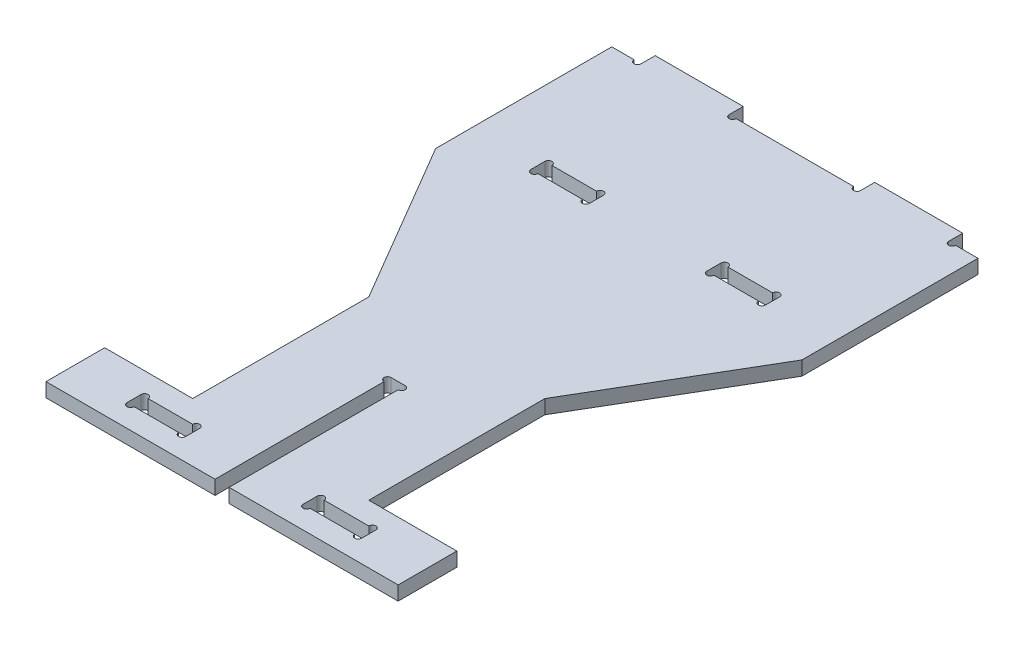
from build123d import *

# Parameters (mm, degrees)
BOSS_EXTRUDE1_DEPTH = 12


with BuildPart() as part:
    # Sketch1 → Boss-Extrude1 (new body)
    with BuildSketch(Plane(origin=(0, 0, 0), x_dir=(1, 0, 0), z_dir=(0, 1, 0))):
        with BuildLine():
            Line((-150, 0), (-6, 0))
            Line((-6, 0), (-6, 144))
            ThreePointArc((-6, 144), (-9, 147), (-6, 150))
            Line((-6, 150), (6, 150))
            ThreePointArc((6, 150), (9, 147), (6, 144))
            Line((6, 144), (6, 0))
            Line((6, 0), (150, 0))
            Line((150, 0), (150, 50))
            Line((150, 50), (75, 50))
            Line((75, 50), (75, 200))
            Line((75, 200), (156, 338))
            Line((156, 338), (156, 488))
            Line((156, 488), (137, 488))
            ThreePointArc((137, 488), (134, 485), (131, 488))
            Line((131, 488), (131, 500))
            Line((131, 500), (56, 500))
            Line((56, 500), (56, 488))
            ThreePointArc((56, 488), (53, 485), (50, 488))
            Line((50, 488), (0, 488))
            Line((0, 488), (-50, 488))
            ThreePointArc((-50, 488), (-53, 485), (-56, 488))
            Line((-56, 488), (-56, 500))
            Line((-56, 500), (-131, 500))
            Line((-131, 500), (-131, 488))
            ThreePointArc((-131, 488), (-134, 485), (-137, 488))
            Line((-137, 488), (-156, 488))
            Line((-156, 488), (-156, 338))
            Line((-156, 338), (-75, 200))
            Line((-75, 200), (-75, 50))
            Line((-75, 50), (-150, 50))
            Line((-150, 50), (-150, 0))
        make_face()
        with BuildLine():
            Line((56, 19), (94, 19))
            ThreePointArc((94, 19), (97, 16), (100, 19))
            Line((100, 19), (100, 31))
            ThreePointArc((100, 31), (97, 34), (94, 31))
            Line((94, 31), (56, 31))
            ThreePointArc((56, 31), (53, 34), (50, 31))
            Line((50, 31), (50, 19))
            ThreePointArc((50, 19), (53, 16), (56, 19))
        make_face(mode=Mode.SUBTRACT)
        with BuildLine():
            Line((56, 375), (94, 375))
            ThreePointArc((94, 375), (97, 378), (100, 375))
            Line((100, 375), (100, 363))
            ThreePointArc((100, 363), (97, 360), (94, 363))
            Line((94, 363), (56, 363))
            ThreePointArc((56, 363), (53, 360), (50, 363))
            Line((50, 363), (50, 375))
            ThreePointArc((50, 375), (53, 378), (56, 375))
        make_face(mode=Mode.SUBTRACT)
        with BuildLine():
            Line((-100, 31), (-100, 19))
            ThreePointArc((-100, 19), (-97, 16), (-94, 19))
            Line((-94, 19), (-56, 19))
            ThreePointArc((-56, 19), (-53, 16), (-50, 19))
            Line((-50, 19), (-50, 31))
            ThreePointArc((-50, 31), (-53, 34), (-56, 31))
            Line((-56, 31), (-94, 31))
            ThreePointArc((-94, 31), (-97, 34), (-100, 31))
        make_face(mode=Mode.SUBTRACT)
        with BuildLine():
            Line((-56, 375), (-94, 375))
            ThreePointArc((-94, 375), (-97, 378), (-100, 375))
            Line((-100, 375), (-100, 363))
            ThreePointArc((-100, 363), (-97, 360), (-94, 363))
            Line((-94, 363), (-56, 363))
            ThreePointArc((-56, 363), (-53, 360), (-50, 363))
            Line((-50, 363), (-50, 375))
            ThreePointArc((-50, 375), (-53, 378), (-56, 375))
        make_face(mode=Mode.SUBTRACT)
    extrude(amount=BOSS_EXTRUDE1_DEPTH)


solid = part.part
